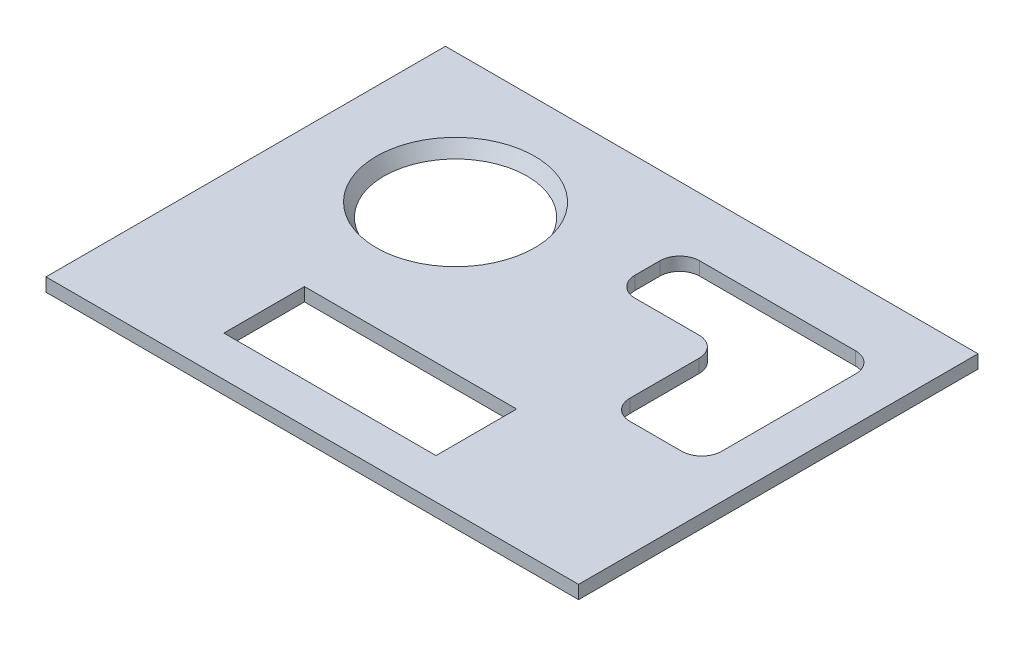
ISO-10303-21;
HEADER;
FILE_DESCRIPTION(('STEP AP214'),'2;1');
FILE_NAME('part.step','',(''),(''),'','','');
FILE_SCHEMA(('AUTOMOTIVE_DESIGN { 1 0 10303 214 1 1 1 1 }'));
ENDSEC;
DATA;
#1=APPLICATION_CONTEXT('core data for automotive mechanical design processes');
#2=APPLICATION_PROTOCOL_DEFINITION('international standard','automotive_design',2000,#1);
#3=PRODUCT_CONTEXT('',#1,'mechanical');
#4=PRODUCT('Part','Part','',(#3));
#5=PRODUCT_RELATED_PRODUCT_CATEGORY('part','',(#4));
#6=PRODUCT_DEFINITION_FORMATION('','',#4);
#7=PRODUCT_DEFINITION_CONTEXT('part definition',#1,'design');
#8=PRODUCT_DEFINITION('design','',#6,#7);
#9=PRODUCT_DEFINITION_SHAPE('','',#8);
#10=(LENGTH_UNIT() NAMED_UNIT(*) SI_UNIT(.MILLI.,.METRE.));
#11=(NAMED_UNIT(*) PLANE_ANGLE_UNIT() SI_UNIT($,.RADIAN.));
#12=(NAMED_UNIT(*) SI_UNIT($,.STERADIAN.) SOLID_ANGLE_UNIT());
#13=UNCERTAINTY_MEASURE_WITH_UNIT(LENGTH_MEASURE(1.E-05),#10,'distance_accuracy_value','');
#14=(GEOMETRIC_REPRESENTATION_CONTEXT(3) GLOBAL_UNCERTAINTY_ASSIGNED_CONTEXT((#13)) GLOBAL_UNIT_ASSIGNED_CONTEXT((#10,
#11,#12)) REPRESENTATION_CONTEXT('',''));
#15=CARTESIAN_POINT('',(0.,0.,0.));
#16=DIRECTION('',(0.,0.,1.));
#17=DIRECTION('',(1.,0.,0.));
#18=AXIS2_PLACEMENT_3D('',#15,#16,#17);
#19=CARTESIAN_POINT('',(0.,2.54,0.));
#20=DIRECTION('',(1.,0.,0.));
#21=DIRECTION('',(0.,0.,-1.));
#22=AXIS2_PLACEMENT_3D('',#19,#20,#21);
#23=PLANE('',#22);
#24=DIRECTION('',(0.,0.,1.));
#25=VECTOR('',#24,1.);
#26=CARTESIAN_POINT('',(0.,0.,0.));
#27=LINE('',#26,#25);
#28=CARTESIAN_POINT('',(0.,0.,-76.2));
#29=VERTEX_POINT('',#28);
#30=CARTESIAN_POINT('',(0.,0.,0.));
#31=VERTEX_POINT('',#30);
#32=EDGE_CURVE('E280',#29,#31,#27,.T.);
#33=ORIENTED_EDGE('',*,*,#32,.T.);
#34=DIRECTION('',(0.,-1.,0.));
#35=VECTOR('',#34,1.);
#36=CARTESIAN_POINT('',(0.,2.54,0.));
#37=LINE('',#36,#35);
#38=CARTESIAN_POINT('',(0.,2.54,0.));
#39=VERTEX_POINT('',#38);
#40=EDGE_CURVE('E11',#39,#31,#37,.T.);
#41=ORIENTED_EDGE('',*,*,#40,.F.);
#42=DIRECTION('',(0.,0.,1.));
#43=VECTOR('',#42,1.);
#44=CARTESIAN_POINT('',(0.,2.54,0.));
#45=LINE('',#44,#43);
#46=CARTESIAN_POINT('',(0.,2.54,-76.2));
#47=VERTEX_POINT('',#46);
#48=EDGE_CURVE('E311',#47,#39,#45,.T.);
#49=ORIENTED_EDGE('',*,*,#48,.F.);
#50=DIRECTION('',(0.,-1.,0.));
#51=VECTOR('',#50,1.);
#52=CARTESIAN_POINT('',(0.,2.54,-76.2));
#53=LINE('',#52,#51);
#54=EDGE_CURVE('E320',#47,#29,#53,.T.);
#55=ORIENTED_EDGE('',*,*,#54,.T.);
#56=EDGE_LOOP('',(#33,#41,#49,#55));
#57=FACE_BOUND('',#56,.T.);
#58=ADVANCED_FACE('F34',(#57),#23,.F.);
#59=CARTESIAN_POINT('',(0.,2.54,0.));
#60=DIRECTION('',(0.,0.,-1.));
#61=DIRECTION('',(-1.,0.,0.));
#62=AXIS2_PLACEMENT_3D('',#59,#60,#61);
#63=PLANE('',#62);
#64=DIRECTION('',(1.,0.,0.));
#65=VECTOR('',#64,1.);
#66=CARTESIAN_POINT('',(0.,0.,0.));
#67=LINE('',#66,#65);
#68=CARTESIAN_POINT('',(101.6,0.,0.));
#69=VERTEX_POINT('',#68);
#70=EDGE_CURVE('E305',#31,#69,#67,.T.);
#71=ORIENTED_EDGE('',*,*,#70,.T.);
#72=DIRECTION('',(0.,-1.,0.));
#73=VECTOR('',#72,1.);
#74=CARTESIAN_POINT('',(101.6,2.54,0.));
#75=LINE('',#74,#73);
#76=CARTESIAN_POINT('',(101.6,2.54,0.));
#77=VERTEX_POINT('',#76);
#78=EDGE_CURVE('E41',#77,#69,#75,.T.);
#79=ORIENTED_EDGE('',*,*,#78,.F.);
#80=DIRECTION('',(1.,0.,0.));
#81=VECTOR('',#80,1.);
#82=CARTESIAN_POINT('',(0.,2.54,0.));
#83=LINE('',#82,#81);
#84=EDGE_CURVE('E314',#39,#77,#83,.T.);
#85=ORIENTED_EDGE('',*,*,#84,.F.);
#86=ORIENTED_EDGE('',*,*,#40,.T.);
#87=EDGE_LOOP('',(#71,#79,#85,#86));
#88=FACE_BOUND('',#87,.T.);
#89=ADVANCED_FACE('F345',(#88),#63,.F.);
#90=CARTESIAN_POINT('',(101.6,2.54,0.));
#91=DIRECTION('',(-1.,0.,0.));
#92=DIRECTION('',(0.,0.,1.));
#93=AXIS2_PLACEMENT_3D('',#90,#91,#92);
#94=PLANE('',#93);
#95=DIRECTION('',(0.,0.,-1.));
#96=VECTOR('',#95,1.);
#97=CARTESIAN_POINT('',(101.6,0.,0.));
#98=LINE('',#97,#96);
#99=CARTESIAN_POINT('',(101.6,0.,-76.2));
#100=VERTEX_POINT('',#99);
#101=EDGE_CURVE('E307',#69,#100,#98,.T.);
#102=ORIENTED_EDGE('',*,*,#101,.T.);
#103=DIRECTION('',(0.,-1.,0.));
#104=VECTOR('',#103,1.);
#105=CARTESIAN_POINT('',(101.6,2.54,-76.2));
#106=LINE('',#105,#104);
#107=CARTESIAN_POINT('',(101.6,2.54,-76.2));
#108=VERTEX_POINT('',#107);
#109=EDGE_CURVE('E323',#108,#100,#106,.T.);
#110=ORIENTED_EDGE('',*,*,#109,.F.);
#111=DIRECTION('',(0.,0.,-1.));
#112=VECTOR('',#111,1.);
#113=CARTESIAN_POINT('',(101.6,2.54,0.));
#114=LINE('',#113,#112);
#115=EDGE_CURVE('E316',#77,#108,#114,.T.);
#116=ORIENTED_EDGE('',*,*,#115,.F.);
#117=ORIENTED_EDGE('',*,*,#78,.T.);
#118=EDGE_LOOP('',(#102,#110,#116,#117));
#119=FACE_BOUND('',#118,.T.);
#120=ADVANCED_FACE('F330',(#119),#94,.F.);
#121=CARTESIAN_POINT('',(0.,2.54,-76.2));
#122=DIRECTION('',(0.,0.,1.));
#123=DIRECTION('',(1.,0.,0.));
#124=AXIS2_PLACEMENT_3D('',#121,#122,#123);
#125=PLANE('',#124);
#126=DIRECTION('',(-1.,0.,0.));
#127=VECTOR('',#126,1.);
#128=CARTESIAN_POINT('',(0.,0.,-76.2));
#129=LINE('',#128,#127);
#130=EDGE_CURVE('E309',#100,#29,#129,.T.);
#131=ORIENTED_EDGE('',*,*,#130,.T.);
#132=ORIENTED_EDGE('',*,*,#54,.F.);
#133=DIRECTION('',(-1.,0.,0.));
#134=VECTOR('',#133,1.);
#135=CARTESIAN_POINT('',(0.,2.54,-76.2));
#136=LINE('',#135,#134);
#137=EDGE_CURVE('E318',#108,#47,#136,.T.);
#138=ORIENTED_EDGE('',*,*,#137,.F.);
#139=ORIENTED_EDGE('',*,*,#109,.T.);
#140=EDGE_LOOP('',(#131,#132,#138,#139));
#141=FACE_BOUND('',#140,.T.);
#142=ADVANCED_FACE('F339',(#141),#125,.F.);
#143=CARTESIAN_POINT('',(0.,2.54,-76.2));
#144=DIRECTION('',(0.,-1.,0.));
#145=DIRECTION('',(0.,0.,-1.));
#146=AXIS2_PLACEMENT_3D('',#143,#144,#145);
#147=PLANE('',#146);
#148=CARTESIAN_POINT('',(26.6952316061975,2.54,-51.4356274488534));
#149=DIRECTION('',(0.,1.,0.));
#150=DIRECTION('',(0.,0.,1.));
#151=AXIS2_PLACEMENT_3D('',#148,#149,#150);
#152=CIRCLE('',#151,15.1162862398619);
#153=CARTESIAN_POINT('',(26.6952316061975,2.54,-36.3193412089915));
#154=VERTEX_POINT('',#153);
#155=EDGE_CURVE('E431',#154,#154,#152,.T.);
#156=ORIENTED_EDGE('',*,*,#155,.F.);
#157=EDGE_LOOP('',(#156));
#158=FACE_BOUND('',#157,.T.);
#159=DIRECTION('',(-1.,0.,0.));
#160=VECTOR('',#159,1.);
#161=CARTESIAN_POINT('',(66.7220162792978,2.54,-23.0583009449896));
#162=LINE('',#161,#160);
#163=CARTESIAN_POINT('',(66.7220162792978,2.54,-23.0583009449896));
#164=VERTEX_POINT('',#163);
#165=CARTESIAN_POINT('',(26.2486362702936,2.54,-23.0583009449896));
#166=VERTEX_POINT('',#165);
#167=EDGE_CURVE('E181',#164,#166,#162,.T.);
#168=ORIENTED_EDGE('',*,*,#167,.F.);
#169=DIRECTION('',(0.,0.,-1.));
#170=VECTOR('',#169,1.);
#171=CARTESIAN_POINT('',(66.7220162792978,2.54,-23.0583009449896));
#172=LINE('',#171,#170);
#173=CARTESIAN_POINT('',(66.7220162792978,2.54,-7.68027256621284));
#174=VERTEX_POINT('',#173);
#175=EDGE_CURVE('E48',#174,#164,#172,.T.);
#176=ORIENTED_EDGE('',*,*,#175,.F.);
#177=DIRECTION('',(1.,0.,0.));
#178=VECTOR('',#177,1.);
#179=CARTESIAN_POINT('',(66.7220162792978,2.54,-7.68027256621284));
#180=LINE('',#179,#178);
#181=CARTESIAN_POINT('',(26.2486362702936,2.54,-7.68027256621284));
#182=VERTEX_POINT('',#181);
#183=EDGE_CURVE('E188',#182,#174,#180,.T.);
#184=ORIENTED_EDGE('',*,*,#183,.F.);
#185=DIRECTION('',(0.,0.,1.));
#186=VECTOR('',#185,1.);
#187=CARTESIAN_POINT('',(26.2486362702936,2.54,-23.0583009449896));
#188=LINE('',#187,#186);
#189=EDGE_CURVE('E172',#166,#182,#188,.T.);
#190=ORIENTED_EDGE('',*,*,#189,.F.);
#191=EDGE_LOOP('',(#168,#176,#184,#190));
#192=FACE_BOUND('',#191,.T.);
#193=DIRECTION('',(0.,0.,-1.));
#194=VECTOR('',#193,1.);
#195=CARTESIAN_POINT('',(93.2641668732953,2.54,-61.2017348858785));
#196=LINE('',#195,#194);
#197=CARTESIAN_POINT('',(93.2641668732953,2.54,-35.6413897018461));
#198=VERTEX_POINT('',#197);
#199=CARTESIAN_POINT('',(93.2641668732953,2.54,-61.2017348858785));
#200=VERTEX_POINT('',#199);
#201=EDGE_CURVE('E208',#198,#200,#196,.T.);
#202=ORIENTED_EDGE('',*,*,#201,.F.);
#203=CARTESIAN_POINT('',(89.4541668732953,2.54,-35.6413897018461));
#204=DIRECTION('',(0.,1.,0.));
#205=DIRECTION('',(0.,0.,-1.));
#206=AXIS2_PLACEMENT_3D('',#203,#204,#205);
#207=CIRCLE('',#206,3.80999999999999);
#208=CARTESIAN_POINT('',(89.4541668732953,2.54,-31.8313897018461));
#209=VERTEX_POINT('',#208);
#210=EDGE_CURVE('E204',#209,#198,#207,.T.);
#211=ORIENTED_EDGE('',*,*,#210,.F.);
#212=DIRECTION('',(1.,0.,0.));
#213=VECTOR('',#212,1.);
#214=CARTESIAN_POINT('',(89.4541668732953,2.54,-31.8313897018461));
#215=LINE('',#214,#213);
#216=CARTESIAN_POINT('',(79.544645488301,2.54,-31.8313897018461));
#217=VERTEX_POINT('',#216);
#218=EDGE_CURVE('E238',#217,#209,#215,.T.);
#219=ORIENTED_EDGE('',*,*,#218,.F.);
#220=CARTESIAN_POINT('',(79.544645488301,2.54,-35.6413897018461));
#221=DIRECTION('',(0.,1.,0.));
#222=DIRECTION('',(0.,0.,-1.));
#223=AXIS2_PLACEMENT_3D('',#220,#221,#222);
#224=CIRCLE('',#223,3.81);
#225=CARTESIAN_POINT('',(75.734645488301,2.54,-35.6413897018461));
#226=VERTEX_POINT('',#225);
#227=EDGE_CURVE('E235',#226,#217,#224,.T.);
#228=ORIENTED_EDGE('',*,*,#227,.F.);
#229=DIRECTION('',(0.,0.,1.));
#230=VECTOR('',#229,1.);
#231=CARTESIAN_POINT('',(75.734645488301,2.54,-35.6413897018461));
#232=LINE('',#231,#230);
#233=CARTESIAN_POINT('',(75.7346454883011,2.54,-48.8574231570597));
#234=VERTEX_POINT('',#233);
#235=EDGE_CURVE('E232',#234,#226,#232,.T.);
#236=ORIENTED_EDGE('',*,*,#235,.F.);
#237=CARTESIAN_POINT('',(71.9246454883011,2.54,-48.8574231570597));
#238=DIRECTION('',(0.,-1.,0.));
#239=DIRECTION('',(0.,0.,1.));
#240=AXIS2_PLACEMENT_3D('',#237,#238,#239);
#241=CIRCLE('',#240,3.81000000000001);
#242=CARTESIAN_POINT('',(71.9246454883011,2.54,-52.6674231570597));
#243=VERTEX_POINT('',#242);
#244=EDGE_CURVE('E229',#243,#234,#241,.T.);
#245=ORIENTED_EDGE('',*,*,#244,.F.);
#246=DIRECTION('',(1.,0.,0.));
#247=VECTOR('',#246,1.);
#248=CARTESIAN_POINT('',(71.9246454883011,2.54,-52.6674231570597));
#249=LINE('',#248,#247);
#250=CARTESIAN_POINT('',(59.7055730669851,2.54,-52.6674231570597));
#251=VERTEX_POINT('',#250);
#252=EDGE_CURVE('E226',#251,#243,#249,.T.);
#253=ORIENTED_EDGE('',*,*,#252,.F.);
#254=CARTESIAN_POINT('',(59.7055730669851,2.54,-56.4774231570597));
#255=DIRECTION('',(0.,1.,0.));
#256=DIRECTION('',(0.,0.,-1.));
#257=AXIS2_PLACEMENT_3D('',#254,#255,#256);
#258=CIRCLE('',#257,3.81);
#259=CARTESIAN_POINT('',(55.8955730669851,2.54,-56.4774231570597));
#260=VERTEX_POINT('',#259);
#261=EDGE_CURVE('E223',#260,#251,#258,.T.);
#262=ORIENTED_EDGE('',*,*,#261,.F.);
#263=DIRECTION('',(0.,0.,1.));
#264=VECTOR('',#263,1.);
#265=CARTESIAN_POINT('',(55.8955730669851,2.54,-56.4774231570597));
#266=LINE('',#265,#264);
#267=CARTESIAN_POINT('',(55.8955730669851,2.54,-61.2017348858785));
#268=VERTEX_POINT('',#267);
#269=EDGE_CURVE('E220',#268,#260,#266,.T.);
#270=ORIENTED_EDGE('',*,*,#269,.F.);
#271=CARTESIAN_POINT('',(59.7055730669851,2.54,-61.2017348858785));
#272=DIRECTION('',(0.,1.,0.));
#273=DIRECTION('',(0.,0.,-1.));
#274=AXIS2_PLACEMENT_3D('',#271,#272,#273);
#275=CIRCLE('',#274,3.80999999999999);
#276=CARTESIAN_POINT('',(59.7055730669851,2.54,-65.0117348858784));
#277=VERTEX_POINT('',#276);
#278=EDGE_CURVE('E217',#277,#268,#275,.T.);
#279=ORIENTED_EDGE('',*,*,#278,.F.);
#280=DIRECTION('',(-1.,0.,0.));
#281=VECTOR('',#280,1.);
#282=CARTESIAN_POINT('',(59.7055730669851,2.54,-65.0117348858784));
#283=LINE('',#282,#281);
#284=CARTESIAN_POINT('',(89.4541668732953,2.54,-65.0117348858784));
#285=VERTEX_POINT('',#284);
#286=EDGE_CURVE('E214',#285,#277,#283,.T.);
#287=ORIENTED_EDGE('',*,*,#286,.F.);
#288=CARTESIAN_POINT('',(89.4541668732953,2.54,-61.2017348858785));
#289=DIRECTION('',(0.,1.,0.));
#290=DIRECTION('',(0.,0.,1.));
#291=AXIS2_PLACEMENT_3D('',#288,#289,#290);
#292=CIRCLE('',#291,3.80999999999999);
#293=EDGE_CURVE('E211',#200,#285,#292,.T.);
#294=ORIENTED_EDGE('',*,*,#293,.F.);
#295=EDGE_LOOP('',(#202,#211,#219,#228,#236,#245,#253,#262,#270,#279,#287,#294));
#296=FACE_BOUND('',#295,.T.);
#297=ORIENTED_EDGE('',*,*,#48,.T.);
#298=ORIENTED_EDGE('',*,*,#84,.T.);
#299=ORIENTED_EDGE('',*,*,#115,.T.);
#300=ORIENTED_EDGE('',*,*,#137,.T.);
#301=EDGE_LOOP('',(#297,#298,#299,#300));
#302=FACE_BOUND('',#301,.T.);
#303=ADVANCED_FACE('F185',(#158,#192,#296,#302),#147,.F.);
#304=CARTESIAN_POINT('',(0.,0.,-76.2));
#305=DIRECTION('',(0.,-1.,0.));
#306=DIRECTION('',(0.,0.,-1.));
#307=AXIS2_PLACEMENT_3D('',#304,#305,#306);
#308=PLANE('',#307);
#309=CARTESIAN_POINT('',(26.6952316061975,0.,-51.4356274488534));
#310=DIRECTION('',(0.,1.,0.));
#311=DIRECTION('',(0.,0.,1.));
#312=AXIS2_PLACEMENT_3D('',#309,#310,#311);
#313=CIRCLE('',#312,13.6498165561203);
#314=CARTESIAN_POINT('',(26.6952316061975,0.,-37.7858108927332));
#315=VERTEX_POINT('',#314);
#316=EDGE_CURVE('E428',#315,#315,#313,.T.);
#317=ORIENTED_EDGE('',*,*,#316,.T.);
#318=EDGE_LOOP('',(#317));
#319=FACE_BOUND('',#318,.T.);
#320=DIRECTION('',(0.,0.,-1.));
#321=VECTOR('',#320,1.);
#322=CARTESIAN_POINT('',(66.7220162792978,0.,-23.0583009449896));
#323=LINE('',#322,#321);
#324=CARTESIAN_POINT('',(66.7220162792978,0.,-7.68027256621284));
#325=VERTEX_POINT('',#324);
#326=CARTESIAN_POINT('',(66.7220162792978,0.,-23.0583009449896));
#327=VERTEX_POINT('',#326);
#328=EDGE_CURVE('E190',#325,#327,#323,.T.);
#329=ORIENTED_EDGE('',*,*,#328,.T.);
#330=DIRECTION('',(-1.,0.,0.));
#331=VECTOR('',#330,1.);
#332=CARTESIAN_POINT('',(66.7220162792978,0.,-23.0583009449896));
#333=LINE('',#332,#331);
#334=CARTESIAN_POINT('',(26.2486362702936,0.,-23.0583009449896));
#335=VERTEX_POINT('',#334);
#336=EDGE_CURVE('E196',#327,#335,#333,.T.);
#337=ORIENTED_EDGE('',*,*,#336,.T.);
#338=DIRECTION('',(0.,0.,1.));
#339=VECTOR('',#338,1.);
#340=CARTESIAN_POINT('',(26.2486362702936,0.,-23.0583009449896));
#341=LINE('',#340,#339);
#342=CARTESIAN_POINT('',(26.2486362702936,0.,-7.68027256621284));
#343=VERTEX_POINT('',#342);
#344=EDGE_CURVE('E56',#335,#343,#341,.T.);
#345=ORIENTED_EDGE('',*,*,#344,.T.);
#346=DIRECTION('',(1.,0.,0.));
#347=VECTOR('',#346,1.);
#348=CARTESIAN_POINT('',(66.7220162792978,0.,-7.68027256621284));
#349=LINE('',#348,#347);
#350=EDGE_CURVE('E199',#343,#325,#349,.T.);
#351=ORIENTED_EDGE('',*,*,#350,.T.);
#352=EDGE_LOOP('',(#329,#337,#345,#351));
#353=FACE_BOUND('',#352,.T.);
#354=CARTESIAN_POINT('',(89.4541668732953,0.,-35.6413897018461));
#355=DIRECTION('',(0.,1.,0.));
#356=DIRECTION('',(0.,0.,-1.));
#357=AXIS2_PLACEMENT_3D('',#354,#355,#356);
#358=CIRCLE('',#357,3.80999999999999);
#359=CARTESIAN_POINT('',(89.4541668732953,0.,-31.8313897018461));
#360=VERTEX_POINT('',#359);
#361=CARTESIAN_POINT('',(93.2641668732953,0.,-35.6413897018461));
#362=VERTEX_POINT('',#361);
#363=EDGE_CURVE('E241',#360,#362,#358,.T.);
#364=ORIENTED_EDGE('',*,*,#363,.T.);
#365=DIRECTION('',(0.,0.,-1.));
#366=VECTOR('',#365,1.);
#367=CARTESIAN_POINT('',(93.2641668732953,0.,-61.2017348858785));
#368=LINE('',#367,#366);
#369=CARTESIAN_POINT('',(93.2641668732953,0.,-61.2017348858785));
#370=VERTEX_POINT('',#369);
#371=EDGE_CURVE('E244',#362,#370,#368,.T.);
#372=ORIENTED_EDGE('',*,*,#371,.T.);
#373=CARTESIAN_POINT('',(89.4541668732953,0.,-61.2017348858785));
#374=DIRECTION('',(0.,1.,0.));
#375=DIRECTION('',(0.,0.,1.));
#376=AXIS2_PLACEMENT_3D('',#373,#374,#375);
#377=CIRCLE('',#376,3.80999999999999);
#378=CARTESIAN_POINT('',(89.4541668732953,0.,-65.0117348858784));
#379=VERTEX_POINT('',#378);
#380=EDGE_CURVE('E247',#370,#379,#377,.T.);
#381=ORIENTED_EDGE('',*,*,#380,.T.);
#382=DIRECTION('',(-1.,0.,0.));
#383=VECTOR('',#382,1.);
#384=CARTESIAN_POINT('',(59.7055730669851,0.,-65.0117348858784));
#385=LINE('',#384,#383);
#386=CARTESIAN_POINT('',(59.7055730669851,0.,-65.0117348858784));
#387=VERTEX_POINT('',#386);
#388=EDGE_CURVE('E250',#379,#387,#385,.T.);
#389=ORIENTED_EDGE('',*,*,#388,.T.);
#390=CARTESIAN_POINT('',(59.7055730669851,0.,-61.2017348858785));
#391=DIRECTION('',(0.,1.,0.));
#392=DIRECTION('',(0.,0.,-1.));
#393=AXIS2_PLACEMENT_3D('',#390,#391,#392);
#394=CIRCLE('',#393,3.80999999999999);
#395=CARTESIAN_POINT('',(55.8955730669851,0.,-61.2017348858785));
#396=VERTEX_POINT('',#395);
#397=EDGE_CURVE('E253',#387,#396,#394,.T.);
#398=ORIENTED_EDGE('',*,*,#397,.T.);
#399=DIRECTION('',(0.,0.,1.));
#400=VECTOR('',#399,1.);
#401=CARTESIAN_POINT('',(55.8955730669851,0.,-56.4774231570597));
#402=LINE('',#401,#400);
#403=CARTESIAN_POINT('',(55.8955730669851,0.,-56.4774231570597));
#404=VERTEX_POINT('',#403);
#405=EDGE_CURVE('E256',#396,#404,#402,.T.);
#406=ORIENTED_EDGE('',*,*,#405,.T.);
#407=CARTESIAN_POINT('',(59.7055730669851,0.,-56.4774231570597));
#408=DIRECTION('',(0.,1.,0.));
#409=DIRECTION('',(0.,0.,-1.));
#410=AXIS2_PLACEMENT_3D('',#407,#408,#409);
#411=CIRCLE('',#410,3.81);
#412=CARTESIAN_POINT('',(59.7055730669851,0.,-52.6674231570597));
#413=VERTEX_POINT('',#412);
#414=EDGE_CURVE('E259',#404,#413,#411,.T.);
#415=ORIENTED_EDGE('',*,*,#414,.T.);
#416=DIRECTION('',(1.,0.,0.));
#417=VECTOR('',#416,1.);
#418=CARTESIAN_POINT('',(71.9246454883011,0.,-52.6674231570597));
#419=LINE('',#418,#417);
#420=CARTESIAN_POINT('',(71.9246454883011,0.,-52.6674231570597));
#421=VERTEX_POINT('',#420);
#422=EDGE_CURVE('E262',#413,#421,#419,.T.);
#423=ORIENTED_EDGE('',*,*,#422,.T.);
#424=CARTESIAN_POINT('',(71.9246454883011,0.,-48.8574231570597));
#425=DIRECTION('',(0.,-1.,0.));
#426=DIRECTION('',(0.,0.,1.));
#427=AXIS2_PLACEMENT_3D('',#424,#425,#426);
#428=CIRCLE('',#427,3.81000000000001);
#429=CARTESIAN_POINT('',(75.7346454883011,0.,-48.8574231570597));
#430=VERTEX_POINT('',#429);
#431=EDGE_CURVE('E265',#421,#430,#428,.T.);
#432=ORIENTED_EDGE('',*,*,#431,.T.);
#433=DIRECTION('',(0.,0.,1.));
#434=VECTOR('',#433,1.);
#435=CARTESIAN_POINT('',(75.734645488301,0.,-35.6413897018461));
#436=LINE('',#435,#434);
#437=CARTESIAN_POINT('',(75.734645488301,0.,-35.6413897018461));
#438=VERTEX_POINT('',#437);
#439=EDGE_CURVE('E268',#430,#438,#436,.T.);
#440=ORIENTED_EDGE('',*,*,#439,.T.);
#441=CARTESIAN_POINT('',(79.544645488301,0.,-35.6413897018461));
#442=DIRECTION('',(0.,1.,0.));
#443=DIRECTION('',(0.,0.,-1.));
#444=AXIS2_PLACEMENT_3D('',#441,#442,#443);
#445=CIRCLE('',#444,3.81);
#446=CARTESIAN_POINT('',(79.544645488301,0.,-31.8313897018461));
#447=VERTEX_POINT('',#446);
#448=EDGE_CURVE('E271',#438,#447,#445,.T.);
#449=ORIENTED_EDGE('',*,*,#448,.T.);
#450=DIRECTION('',(1.,0.,0.));
#451=VECTOR('',#450,1.);
#452=CARTESIAN_POINT('',(89.4541668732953,0.,-31.8313897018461));
#453=LINE('',#452,#451);
#454=EDGE_CURVE('E274',#447,#360,#453,.T.);
#455=ORIENTED_EDGE('',*,*,#454,.T.);
#456=EDGE_LOOP('',(#364,#372,#381,#389,#398,#406,#415,#423,#432,#440,#449,#455));
#457=FACE_BOUND('',#456,.T.);
#458=ORIENTED_EDGE('',*,*,#32,.F.);
#459=ORIENTED_EDGE('',*,*,#130,.F.);
#460=ORIENTED_EDGE('',*,*,#101,.F.);
#461=ORIENTED_EDGE('',*,*,#70,.F.);
#462=EDGE_LOOP('',(#458,#459,#460,#461));
#463=FACE_BOUND('',#462,.T.);
#464=ADVANCED_FACE('F336',(#319,#353,#457,#463),#308,.T.);
#465=CARTESIAN_POINT('',(89.4541668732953,0.,-35.6413897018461));
#466=DIRECTION('',(0.,1.,0.));
#467=DIRECTION('',(0.,0.,1.));
#468=AXIS2_PLACEMENT_3D('',#465,#466,#467);
#469=CYLINDRICAL_SURFACE('',#468,3.80999999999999);
#470=ORIENTED_EDGE('',*,*,#210,.T.);
#471=DIRECTION('',(0.,1.,0.));
#472=VECTOR('',#471,1.);
#473=CARTESIAN_POINT('',(93.2641668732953,0.,-35.6413897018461));
#474=LINE('',#473,#472);
#475=EDGE_CURVE('E277',#362,#198,#474,.T.);
#476=ORIENTED_EDGE('',*,*,#475,.F.);
#477=ORIENTED_EDGE('',*,*,#363,.F.);
#478=DIRECTION('',(0.,1.,0.));
#479=VECTOR('',#478,1.);
#480=CARTESIAN_POINT('',(89.4541668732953,0.,-31.8313897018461));
#481=LINE('',#480,#479);
#482=EDGE_CURVE('E278',#360,#209,#481,.T.);
#483=ORIENTED_EDGE('',*,*,#482,.T.);
#484=EDGE_LOOP('',(#470,#476,#477,#483));
#485=FACE_BOUND('',#484,.T.);
#486=ADVANCED_FACE('F360',(#485),#469,.F.);
#487=CARTESIAN_POINT('',(89.4541668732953,0.,-31.8313897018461));
#488=DIRECTION('',(0.,0.,1.));
#489=DIRECTION('',(1.,0.,0.));
#490=AXIS2_PLACEMENT_3D('',#487,#488,#489);
#491=PLANE('',#490);
#492=ORIENTED_EDGE('',*,*,#218,.T.);
#493=ORIENTED_EDGE('',*,*,#482,.F.);
#494=ORIENTED_EDGE('',*,*,#454,.F.);
#495=DIRECTION('',(0.,1.,0.));
#496=VECTOR('',#495,1.);
#497=CARTESIAN_POINT('',(79.544645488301,0.,-31.8313897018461));
#498=LINE('',#497,#496);
#499=EDGE_CURVE('E281',#447,#217,#498,.T.);
#500=ORIENTED_EDGE('',*,*,#499,.T.);
#501=EDGE_LOOP('',(#492,#493,#494,#500));
#502=FACE_BOUND('',#501,.T.);
#503=ADVANCED_FACE('F364',(#502),#491,.F.);
#504=CARTESIAN_POINT('',(79.544645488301,0.,-35.6413897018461));
#505=DIRECTION('',(0.,1.,0.));
#506=DIRECTION('',(0.,0.,1.));
#507=AXIS2_PLACEMENT_3D('',#504,#505,#506);
#508=CYLINDRICAL_SURFACE('',#507,3.81);
#509=ORIENTED_EDGE('',*,*,#227,.T.);
#510=ORIENTED_EDGE('',*,*,#499,.F.);
#511=ORIENTED_EDGE('',*,*,#448,.F.);
#512=DIRECTION('',(0.,1.,0.));
#513=VECTOR('',#512,1.);
#514=CARTESIAN_POINT('',(75.734645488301,0.,-35.6413897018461));
#515=LINE('',#514,#513);
#516=EDGE_CURVE('E283',#438,#226,#515,.T.);
#517=ORIENTED_EDGE('',*,*,#516,.T.);
#518=EDGE_LOOP('',(#509,#510,#511,#517));
#519=FACE_BOUND('',#518,.T.);
#520=ADVANCED_FACE('F402',(#519),#508,.F.);
#521=CARTESIAN_POINT('',(75.734645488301,0.,-35.6413897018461));
#522=DIRECTION('',(-1.,0.,0.));
#523=DIRECTION('',(0.,0.,1.));
#524=AXIS2_PLACEMENT_3D('',#521,#522,#523);
#525=PLANE('',#524);
#526=ORIENTED_EDGE('',*,*,#235,.T.);
#527=ORIENTED_EDGE('',*,*,#516,.F.);
#528=ORIENTED_EDGE('',*,*,#439,.F.);
#529=DIRECTION('',(0.,1.,0.));
#530=VECTOR('',#529,1.);
#531=CARTESIAN_POINT('',(75.7346454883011,0.,-48.8574231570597));
#532=LINE('',#531,#530);
#533=EDGE_CURVE('E285',#430,#234,#532,.T.);
#534=ORIENTED_EDGE('',*,*,#533,.T.);
#535=EDGE_LOOP('',(#526,#527,#528,#534));
#536=FACE_BOUND('',#535,.T.);
#537=ADVANCED_FACE('F398',(#536),#525,.F.);
#538=CARTESIAN_POINT('',(71.9246454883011,0.,-48.8574231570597));
#539=DIRECTION('',(0.,1.,0.));
#540=DIRECTION('',(0.,0.,1.));
#541=AXIS2_PLACEMENT_3D('',#538,#539,#540);
#542=CYLINDRICAL_SURFACE('',#541,3.81000000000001);
#543=ORIENTED_EDGE('',*,*,#244,.T.);
#544=ORIENTED_EDGE('',*,*,#533,.F.);
#545=ORIENTED_EDGE('',*,*,#431,.F.);
#546=DIRECTION('',(0.,1.,0.));
#547=VECTOR('',#546,1.);
#548=CARTESIAN_POINT('',(71.9246454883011,0.,-52.6674231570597));
#549=LINE('',#548,#547);
#550=EDGE_CURVE('E287',#421,#243,#549,.T.);
#551=ORIENTED_EDGE('',*,*,#550,.T.);
#552=EDGE_LOOP('',(#543,#544,#545,#551));
#553=FACE_BOUND('',#552,.T.);
#554=ADVANCED_FACE('F394',(#553),#542,.T.);
#555=CARTESIAN_POINT('',(71.9246454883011,0.,-52.6674231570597));
#556=DIRECTION('',(0.,0.,1.));
#557=DIRECTION('',(1.,0.,0.));
#558=AXIS2_PLACEMENT_3D('',#555,#556,#557);
#559=PLANE('',#558);
#560=ORIENTED_EDGE('',*,*,#252,.T.);
#561=ORIENTED_EDGE('',*,*,#550,.F.);
#562=ORIENTED_EDGE('',*,*,#422,.F.);
#563=DIRECTION('',(0.,1.,0.));
#564=VECTOR('',#563,1.);
#565=CARTESIAN_POINT('',(59.7055730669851,0.,-52.6674231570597));
#566=LINE('',#565,#564);
#567=EDGE_CURVE('E289',#413,#251,#566,.T.);
#568=ORIENTED_EDGE('',*,*,#567,.T.);
#569=EDGE_LOOP('',(#560,#561,#562,#568));
#570=FACE_BOUND('',#569,.T.);
#571=ADVANCED_FACE('F390',(#570),#559,.F.);
#572=CARTESIAN_POINT('',(59.7055730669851,0.,-56.4774231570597));
#573=DIRECTION('',(0.,1.,0.));
#574=DIRECTION('',(0.,0.,1.));
#575=AXIS2_PLACEMENT_3D('',#572,#573,#574);
#576=CYLINDRICAL_SURFACE('',#575,3.81);
#577=ORIENTED_EDGE('',*,*,#261,.T.);
#578=ORIENTED_EDGE('',*,*,#567,.F.);
#579=ORIENTED_EDGE('',*,*,#414,.F.);
#580=DIRECTION('',(0.,1.,0.));
#581=VECTOR('',#580,1.);
#582=CARTESIAN_POINT('',(55.8955730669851,0.,-56.4774231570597));
#583=LINE('',#582,#581);
#584=EDGE_CURVE('E291',#404,#260,#583,.T.);
#585=ORIENTED_EDGE('',*,*,#584,.T.);
#586=EDGE_LOOP('',(#577,#578,#579,#585));
#587=FACE_BOUND('',#586,.T.);
#588=ADVANCED_FACE('F386',(#587),#576,.F.);
#589=CARTESIAN_POINT('',(55.8955730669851,0.,-56.4774231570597));
#590=DIRECTION('',(-1.,0.,0.));
#591=DIRECTION('',(0.,0.,1.));
#592=AXIS2_PLACEMENT_3D('',#589,#590,#591);
#593=PLANE('',#592);
#594=ORIENTED_EDGE('',*,*,#269,.T.);
#595=ORIENTED_EDGE('',*,*,#584,.F.);
#596=ORIENTED_EDGE('',*,*,#405,.F.);
#597=DIRECTION('',(0.,1.,0.));
#598=VECTOR('',#597,1.);
#599=CARTESIAN_POINT('',(55.8955730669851,0.,-61.2017348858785));
#600=LINE('',#599,#598);
#601=EDGE_CURVE('E293',#396,#268,#600,.T.);
#602=ORIENTED_EDGE('',*,*,#601,.T.);
#603=EDGE_LOOP('',(#594,#595,#596,#602));
#604=FACE_BOUND('',#603,.T.);
#605=ADVANCED_FACE('F382',(#604),#593,.F.);
#606=CARTESIAN_POINT('',(59.7055730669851,0.,-61.2017348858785));
#607=DIRECTION('',(0.,1.,0.));
#608=DIRECTION('',(0.,0.,1.));
#609=AXIS2_PLACEMENT_3D('',#606,#607,#608);
#610=CYLINDRICAL_SURFACE('',#609,3.80999999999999);
#611=ORIENTED_EDGE('',*,*,#278,.T.);
#612=ORIENTED_EDGE('',*,*,#601,.F.);
#613=ORIENTED_EDGE('',*,*,#397,.F.);
#614=DIRECTION('',(0.,1.,0.));
#615=VECTOR('',#614,1.);
#616=CARTESIAN_POINT('',(59.7055730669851,0.,-65.0117348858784));
#617=LINE('',#616,#615);
#618=EDGE_CURVE('E295',#387,#277,#617,.T.);
#619=ORIENTED_EDGE('',*,*,#618,.T.);
#620=EDGE_LOOP('',(#611,#612,#613,#619));
#621=FACE_BOUND('',#620,.T.);
#622=ADVANCED_FACE('F378',(#621),#610,.F.);
#623=CARTESIAN_POINT('',(59.7055730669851,0.,-65.0117348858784));
#624=DIRECTION('',(0.,0.,-1.));
#625=DIRECTION('',(-1.,0.,0.));
#626=AXIS2_PLACEMENT_3D('',#623,#624,#625);
#627=PLANE('',#626);
#628=ORIENTED_EDGE('',*,*,#286,.T.);
#629=ORIENTED_EDGE('',*,*,#618,.F.);
#630=ORIENTED_EDGE('',*,*,#388,.F.);
#631=DIRECTION('',(0.,1.,0.));
#632=VECTOR('',#631,1.);
#633=CARTESIAN_POINT('',(89.4541668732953,0.,-65.0117348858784));
#634=LINE('',#633,#632);
#635=EDGE_CURVE('E297',#379,#285,#634,.T.);
#636=ORIENTED_EDGE('',*,*,#635,.T.);
#637=EDGE_LOOP('',(#628,#629,#630,#636));
#638=FACE_BOUND('',#637,.T.);
#639=ADVANCED_FACE('F374',(#638),#627,.F.);
#640=CARTESIAN_POINT('',(89.4541668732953,0.,-61.2017348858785));
#641=DIRECTION('',(0.,1.,0.));
#642=DIRECTION('',(0.,0.,1.));
#643=AXIS2_PLACEMENT_3D('',#640,#641,#642);
#644=CYLINDRICAL_SURFACE('',#643,3.80999999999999);
#645=ORIENTED_EDGE('',*,*,#293,.T.);
#646=ORIENTED_EDGE('',*,*,#635,.F.);
#647=ORIENTED_EDGE('',*,*,#380,.F.);
#648=DIRECTION('',(0.,1.,0.));
#649=VECTOR('',#648,1.);
#650=CARTESIAN_POINT('',(93.2641668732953,0.,-61.2017348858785));
#651=LINE('',#650,#649);
#652=EDGE_CURVE('E299',#370,#200,#651,.T.);
#653=ORIENTED_EDGE('',*,*,#652,.T.);
#654=EDGE_LOOP('',(#645,#646,#647,#653));
#655=FACE_BOUND('',#654,.T.);
#656=ADVANCED_FACE('F370',(#655),#644,.F.);
#657=CARTESIAN_POINT('',(93.2641668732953,0.,-61.2017348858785));
#658=DIRECTION('',(1.,0.,0.));
#659=DIRECTION('',(0.,0.,-1.));
#660=AXIS2_PLACEMENT_3D('',#657,#658,#659);
#661=PLANE('',#660);
#662=ORIENTED_EDGE('',*,*,#201,.T.);
#663=ORIENTED_EDGE('',*,*,#652,.F.);
#664=ORIENTED_EDGE('',*,*,#371,.F.);
#665=ORIENTED_EDGE('',*,*,#475,.T.);
#666=EDGE_LOOP('',(#662,#663,#664,#665));
#667=FACE_BOUND('',#666,.T.);
#668=ADVANCED_FACE('F366',(#667),#661,.F.);
#669=CARTESIAN_POINT('',(66.7220162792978,0.,-23.0583009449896));
#670=DIRECTION('',(1.,0.,0.));
#671=DIRECTION('',(0.,0.,-1.));
#672=AXIS2_PLACEMENT_3D('',#669,#670,#671);
#673=PLANE('',#672);
#674=ORIENTED_EDGE('',*,*,#175,.T.);
#675=DIRECTION('',(0.,1.,0.));
#676=VECTOR('',#675,1.);
#677=CARTESIAN_POINT('',(66.7220162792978,0.,-23.0583009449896));
#678=LINE('',#677,#676);
#679=EDGE_CURVE('E178',#327,#164,#678,.T.);
#680=ORIENTED_EDGE('',*,*,#679,.F.);
#681=ORIENTED_EDGE('',*,*,#328,.F.);
#682=DIRECTION('',(0.,1.,0.));
#683=VECTOR('',#682,1.);
#684=CARTESIAN_POINT('',(66.7220162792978,0.,-7.68027256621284));
#685=LINE('',#684,#683);
#686=EDGE_CURVE('E202',#325,#174,#685,.T.);
#687=ORIENTED_EDGE('',*,*,#686,.T.);
#688=EDGE_LOOP('',(#674,#680,#681,#687));
#689=FACE_BOUND('',#688,.T.);
#690=ADVANCED_FACE('F369',(#689),#673,.F.);
#691=CARTESIAN_POINT('',(66.7220162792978,0.,-7.68027256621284));
#692=DIRECTION('',(0.,0.,1.));
#693=DIRECTION('',(1.,0.,0.));
#694=AXIS2_PLACEMENT_3D('',#691,#692,#693);
#695=PLANE('',#694);
#696=ORIENTED_EDGE('',*,*,#183,.T.);
#697=ORIENTED_EDGE('',*,*,#686,.F.);
#698=ORIENTED_EDGE('',*,*,#350,.F.);
#699=DIRECTION('',(0.,1.,0.));
#700=VECTOR('',#699,1.);
#701=CARTESIAN_POINT('',(26.2486362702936,0.,-7.68027256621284));
#702=LINE('',#701,#700);
#703=EDGE_CURVE('E177',#343,#182,#702,.T.);
#704=ORIENTED_EDGE('',*,*,#703,.T.);
#705=EDGE_LOOP('',(#696,#697,#698,#704));
#706=FACE_BOUND('',#705,.T.);
#707=ADVANCED_FACE('F412',(#706),#695,.F.);
#708=CARTESIAN_POINT('',(26.2486362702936,0.,-23.0583009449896));
#709=DIRECTION('',(-1.,0.,0.));
#710=DIRECTION('',(0.,0.,1.));
#711=AXIS2_PLACEMENT_3D('',#708,#709,#710);
#712=PLANE('',#711);
#713=ORIENTED_EDGE('',*,*,#189,.T.);
#714=ORIENTED_EDGE('',*,*,#703,.F.);
#715=ORIENTED_EDGE('',*,*,#344,.F.);
#716=DIRECTION('',(0.,1.,0.));
#717=VECTOR('',#716,1.);
#718=CARTESIAN_POINT('',(26.2486362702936,0.,-23.0583009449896));
#719=LINE('',#718,#717);
#720=EDGE_CURVE('E168',#335,#166,#719,.T.);
#721=ORIENTED_EDGE('',*,*,#720,.T.);
#722=EDGE_LOOP('',(#713,#714,#715,#721));
#723=FACE_BOUND('',#722,.T.);
#724=ADVANCED_FACE('F170',(#723),#712,.F.);
#725=CARTESIAN_POINT('',(66.7220162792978,0.,-23.0583009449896));
#726=DIRECTION('',(0.,0.,-1.));
#727=DIRECTION('',(-1.,0.,0.));
#728=AXIS2_PLACEMENT_3D('',#725,#726,#727);
#729=PLANE('',#728);
#730=ORIENTED_EDGE('',*,*,#167,.T.);
#731=ORIENTED_EDGE('',*,*,#720,.F.);
#732=ORIENTED_EDGE('',*,*,#336,.F.);
#733=ORIENTED_EDGE('',*,*,#679,.T.);
#734=EDGE_LOOP('',(#730,#731,#732,#733));
#735=FACE_BOUND('',#734,.T.);
#736=ADVANCED_FACE('F182',(#735),#729,.F.);
#737=CARTESIAN_POINT('',(26.6952316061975,2.54,-51.4356274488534));
#738=DIRECTION('',(0.,1.,0.));
#739=DIRECTION('',(0.,0.,1.));
#740=AXIS2_PLACEMENT_3D('',#737,#738,#739);
#741=CONICAL_SURFACE('',#740,15.1162862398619,0.5235987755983);
#742=ORIENTED_EDGE('',*,*,#316,.F.);
#743=EDGE_LOOP('',(#742));
#744=FACE_BOUND('',#743,.T.);
#745=ORIENTED_EDGE('',*,*,#155,.T.);
#746=EDGE_LOOP('',(#745));
#747=FACE_BOUND('',#746,.T.);
#748=ADVANCED_FACE('F415',(#744,#747),#741,.F.);
#749=CLOSED_SHELL('',(#58,#89,#120,#142,#303,#464,#486,#503,#520,#537,#554,#571,#588,#605,#622,
#639,#656,#668,#690,#707,#724,#736,#748));
#750=MANIFOLD_SOLID_BREP('B2',#749);
#751=ADVANCED_BREP_SHAPE_REPRESENTATION('',(#18,#750),#14);
#752=SHAPE_DEFINITION_REPRESENTATION(#9,#751);
ENDSEC;
END-ISO-10303-21;
